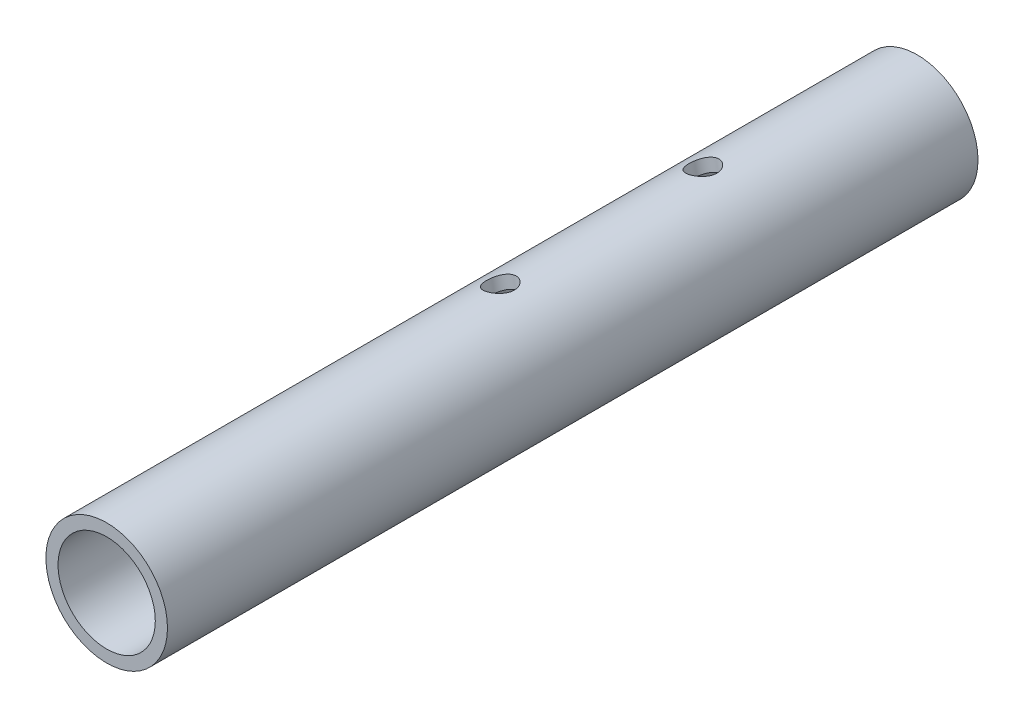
from build123d import *

# Parameters (mm, degrees)
ESQUISSE1_R             = 15
ESQUISSE1_R_2           = 12
BOSS_EXTRU_1_DEPTH      = 200
ESQUISSE2_R             = 3.5
ENL_V_MAT_EXTRU_1_DEPTH = 204.869937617


with BuildPart() as part:
    # Esquisse1 → Boss.-Extru.1 (new body)
    with BuildSketch(Plane.XY):
        with Locations((-10.424186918, -1.53847981)):
            Circle(ESQUISSE1_R)
        with Locations((-10.424186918, -1.53847981)):
            Circle(ESQUISSE1_R_2, mode=Mode.SUBTRACT)
    extrude(amount=BOSS_EXTRU_1_DEPTH)

    # Esquisse2 → Enl_v. mat.-Extru.1 (cut, through all)
    with BuildSketch(Plane(origin=(2.826385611, -14.194521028, 0), x_dir=(0.9807466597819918, 0.19528438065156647, 0), z_dir=(0.19528438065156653, -0.9807466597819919, 0))):
        with Locations((-10.523927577, 100)):
            Circle(ESQUISSE2_R)
        with Locations((-10.523927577, 50)):
            Circle(ESQUISSE2_R)
    extrude(amount=-ENL_V_MAT_EXTRU_1_DEPTH, mode=Mode.SUBTRACT)


solid = part.part
